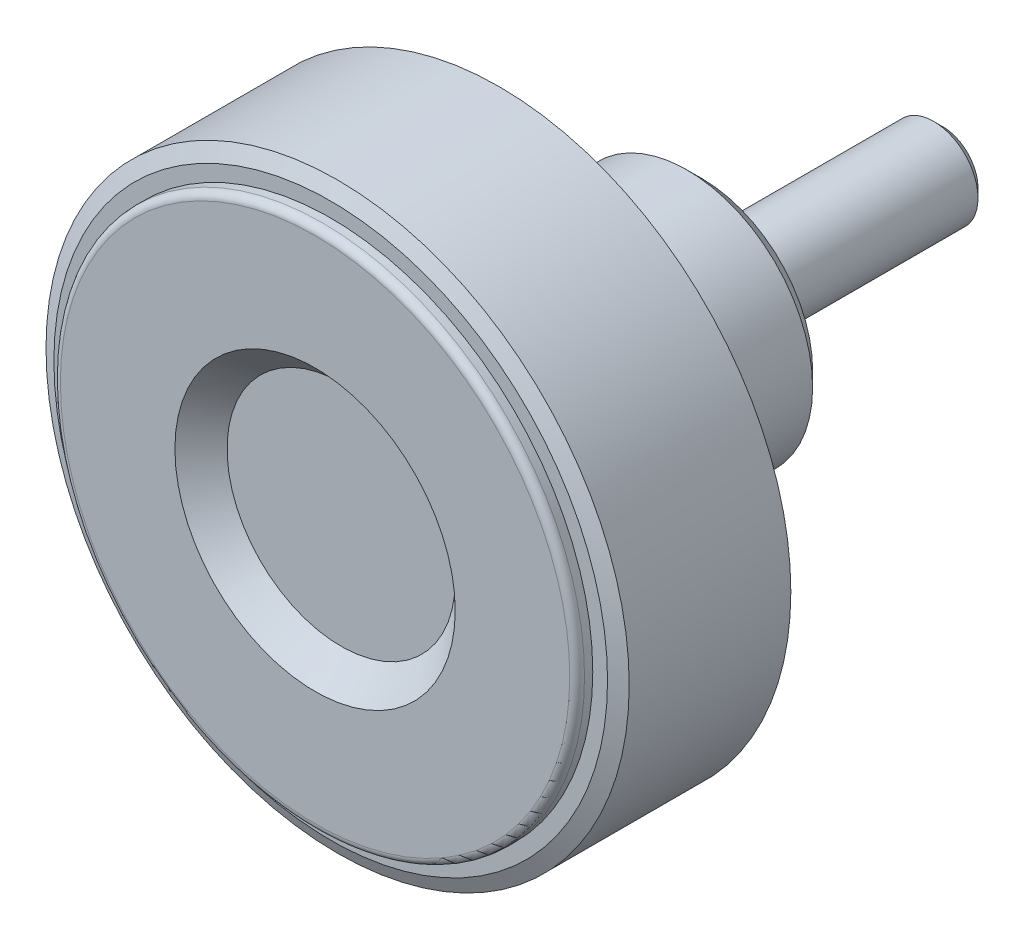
ISO-10303-21;
HEADER;
FILE_DESCRIPTION(('STEP AP214'),'2;1');
FILE_NAME('part.step','',(''),(''),'','','');
FILE_SCHEMA(('AUTOMOTIVE_DESIGN { 1 0 10303 214 1 1 1 1 }'));
ENDSEC;
DATA;
#1=APPLICATION_CONTEXT('core data for automotive mechanical design processes');
#2=APPLICATION_PROTOCOL_DEFINITION('international standard','automotive_design',2000,#1);
#3=PRODUCT_CONTEXT('',#1,'mechanical');
#4=PRODUCT('Part','Part','',(#3));
#5=PRODUCT_RELATED_PRODUCT_CATEGORY('part','',(#4));
#6=PRODUCT_DEFINITION_FORMATION('','',#4);
#7=PRODUCT_DEFINITION_CONTEXT('part definition',#1,'design');
#8=PRODUCT_DEFINITION('design','',#6,#7);
#9=PRODUCT_DEFINITION_SHAPE('','',#8);
#10=(LENGTH_UNIT() NAMED_UNIT(*) SI_UNIT(.MILLI.,.METRE.));
#11=(NAMED_UNIT(*) PLANE_ANGLE_UNIT() SI_UNIT($,.RADIAN.));
#12=(NAMED_UNIT(*) SI_UNIT($,.STERADIAN.) SOLID_ANGLE_UNIT());
#13=UNCERTAINTY_MEASURE_WITH_UNIT(LENGTH_MEASURE(1.E-05),#10,'distance_accuracy_value','');
#14=(GEOMETRIC_REPRESENTATION_CONTEXT(3) GLOBAL_UNCERTAINTY_ASSIGNED_CONTEXT((#13)) GLOBAL_UNIT_ASSIGNED_CONTEXT((#10,
#11,#12)) REPRESENTATION_CONTEXT('',''));
#15=CARTESIAN_POINT('',(0.,0.,0.));
#16=DIRECTION('',(0.,0.,1.));
#17=DIRECTION('',(1.,0.,0.));
#18=AXIS2_PLACEMENT_3D('',#15,#16,#17);
#19=CARTESIAN_POINT('',(0.,0.,-4.19325));
#20=DIRECTION('',(0.,0.,1.));
#21=DIRECTION('',(1.,0.,0.));
#22=AXIS2_PLACEMENT_3D('',#19,#20,#21);
#23=CYLINDRICAL_SURFACE('',#22,3.);
#24=CARTESIAN_POINT('',(0.,0.,-15.4));
#25=DIRECTION('',(0.,0.,-1.));
#26=DIRECTION('',(-1.,0.,0.));
#27=AXIS2_PLACEMENT_3D('',#24,#25,#26);
#28=CIRCLE('',#27,3.);
#29=CARTESIAN_POINT('',(-3.,0.,-15.4));
#30=VERTEX_POINT('',#29);
#31=EDGE_CURVE('E9',#30,#30,#28,.F.);
#32=ORIENTED_EDGE('',*,*,#31,.T.);
#33=EDGE_LOOP('',(#32));
#34=FACE_BOUND('',#33,.T.);
#35=CARTESIAN_POINT('',(0.,0.,0.));
#36=DIRECTION('',(0.,0.,1.));
#37=DIRECTION('',(1.,0.,0.));
#38=AXIS2_PLACEMENT_3D('',#35,#36,#37);
#39=CIRCLE('',#38,3.);
#40=CARTESIAN_POINT('',(3.,0.,0.));
#41=VERTEX_POINT('',#40);
#42=EDGE_CURVE('E212',#41,#41,#39,.T.);
#43=ORIENTED_EDGE('',*,*,#42,.F.);
#44=EDGE_LOOP('',(#43));
#45=FACE_BOUND('',#44,.T.);
#46=ADVANCED_FACE('F14',(#34,#45),#23,.T.);
#47=CARTESIAN_POINT('',(0.,2.,0.));
#48=DIRECTION('',(0.,0.,-1.));
#49=DIRECTION('',(-1.,0.,0.));
#50=AXIS2_PLACEMENT_3D('',#47,#48,#49);
#51=PLANE('',#50);
#52=CARTESIAN_POINT('',(0.,0.,0.));
#53=DIRECTION('',(0.,0.,1.));
#54=DIRECTION('',(1.,0.,0.));
#55=AXIS2_PLACEMENT_3D('',#52,#53,#54);
#56=CIRCLE('',#55,4.);
#57=CARTESIAN_POINT('',(4.,0.,0.));
#58=VERTEX_POINT('',#57);
#59=EDGE_CURVE('E209',#58,#58,#56,.T.);
#60=ORIENTED_EDGE('',*,*,#59,.F.);
#61=EDGE_LOOP('',(#60));
#62=FACE_BOUND('',#61,.T.);
#63=ORIENTED_EDGE('',*,*,#42,.T.);
#64=EDGE_LOOP('',(#63));
#65=FACE_BOUND('',#64,.T.);
#66=ADVANCED_FACE('F402',(#62,#65),#51,.T.);
#67=CARTESIAN_POINT('',(0.,0.,0.15));
#68=DIRECTION('',(0.,0.,1.));
#69=DIRECTION('',(1.,0.,0.));
#70=AXIS2_PLACEMENT_3D('',#67,#68,#69);
#71=CYLINDRICAL_SURFACE('',#70,4.);
#72=ORIENTED_EDGE('',*,*,#59,.T.);
#73=EDGE_LOOP('',(#72));
#74=FACE_BOUND('',#73,.T.);
#75=CARTESIAN_POINT('',(0.,0.,0.3));
#76=DIRECTION('',(0.,0.,1.));
#77=DIRECTION('',(1.,0.,0.));
#78=AXIS2_PLACEMENT_3D('',#75,#76,#77);
#79=CIRCLE('',#78,4.);
#80=CARTESIAN_POINT('',(4.,0.,0.3));
#81=VERTEX_POINT('',#80);
#82=EDGE_CURVE('E206',#81,#81,#79,.T.);
#83=ORIENTED_EDGE('',*,*,#82,.F.);
#84=EDGE_LOOP('',(#83));
#85=FACE_BOUND('',#84,.T.);
#86=ADVANCED_FACE('F406',(#74,#85),#71,.T.);
#87=CARTESIAN_POINT('',(0.,5.75,0.3));
#88=DIRECTION('',(0.,0.,-1.));
#89=DIRECTION('',(-1.,0.,0.));
#90=AXIS2_PLACEMENT_3D('',#87,#88,#89);
#91=PLANE('',#90);
#92=CARTESIAN_POINT('',(0.,0.,0.3));
#93=DIRECTION('',(0.,0.,1.));
#94=DIRECTION('',(1.,0.,0.));
#95=AXIS2_PLACEMENT_3D('',#92,#93,#94);
#96=CIRCLE('',#95,7.5);
#97=CARTESIAN_POINT('',(7.5,0.,0.3));
#98=VERTEX_POINT('',#97);
#99=EDGE_CURVE('E175',#98,#98,#96,.T.);
#100=ORIENTED_EDGE('',*,*,#99,.F.);
#101=EDGE_LOOP('',(#100));
#102=FACE_BOUND('',#101,.T.);
#103=ORIENTED_EDGE('',*,*,#82,.T.);
#104=EDGE_LOOP('',(#103));
#105=FACE_BOUND('',#104,.T.);
#106=ADVANCED_FACE('F413',(#102,#105),#91,.T.);
#107=CARTESIAN_POINT('',(0.,0.,1.3));
#108=DIRECTION('',(0.,0.,1.));
#109=DIRECTION('',(1.,0.,0.));
#110=AXIS2_PLACEMENT_3D('',#107,#108,#109);
#111=CONICAL_SURFACE('',#110,8.5,0.785398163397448);
#112=ORIENTED_EDGE('',*,*,#99,.T.);
#113=EDGE_LOOP('',(#112));
#114=FACE_BOUND('',#113,.T.);
#115=CARTESIAN_POINT('',(0.,0.,1.3));
#116=DIRECTION('',(0.,0.,1.));
#117=DIRECTION('',(1.,0.,0.));
#118=AXIS2_PLACEMENT_3D('',#115,#116,#117);
#119=CIRCLE('',#118,8.5);
#120=CARTESIAN_POINT('',(8.5,0.,1.3));
#121=VERTEX_POINT('',#120);
#122=EDGE_CURVE('E172',#121,#121,#119,.T.);
#123=ORIENTED_EDGE('',*,*,#122,.F.);
#124=EDGE_LOOP('',(#123));
#125=FACE_BOUND('',#124,.T.);
#126=ADVANCED_FACE('F420',(#114,#125),#111,.T.);
#127=CARTESIAN_POINT('',(0.,0.,11.1916666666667));
#128=DIRECTION('',(0.,0.,1.));
#129=DIRECTION('',(1.,0.,0.));
#130=AXIS2_PLACEMENT_3D('',#127,#128,#129);
#131=CYLINDRICAL_SURFACE('',#130,8.5);
#132=ORIENTED_EDGE('',*,*,#122,.T.);
#133=EDGE_LOOP('',(#132));
#134=FACE_BOUND('',#133,.T.);
#135=CARTESIAN_POINT('',(0.,0.,21.0833333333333));
#136=DIRECTION('',(0.,0.,-1.));
#137=DIRECTION('',(-1.,0.,0.));
#138=AXIS2_PLACEMENT_3D('',#135,#136,#137);
#139=CIRCLE('',#138,8.5);
#140=CARTESIAN_POINT('',(-8.5,0.,21.0833333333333));
#141=VERTEX_POINT('',#140);
#142=EDGE_CURVE('E75',#141,#141,#139,.T.);
#143=ORIENTED_EDGE('',*,*,#142,.T.);
#144=EDGE_LOOP('',(#143));
#145=FACE_BOUND('',#144,.T.);
#146=ADVANCED_FACE('F423',(#134,#145),#131,.T.);
#147=CARTESIAN_POINT('',(0.,0.,21.0833333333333));
#148=DIRECTION('',(0.,0.,-1.));
#149=DIRECTION('',(-1.,0.,0.));
#150=AXIS2_PLACEMENT_3D('',#147,#148,#149);
#151=TOROIDAL_SURFACE('',#150,9.5,1.);
#152=CARTESIAN_POINT('',(0.,0.,22.0833333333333));
#153=DIRECTION('',(0.,0.,-1.));
#154=DIRECTION('',(1.,0.,0.));
#155=AXIS2_PLACEMENT_3D('',#152,#153,#154);
#156=CIRCLE('',#155,9.5);
#157=CARTESIAN_POINT('',(-9.5,0.,22.0833333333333));
#158=VERTEX_POINT('',#157);
#159=CARTESIAN_POINT('',(9.5,0.,22.0833333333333));
#160=VERTEX_POINT('',#159);
#161=EDGE_CURVE('E68',#158,#160,#156,.F.);
#162=ORIENTED_EDGE('',*,*,#161,.F.);
#163=CARTESIAN_POINT('',(0.,0.,22.0833333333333));
#164=DIRECTION('',(0.,0.,-1.));
#165=DIRECTION('',(-1.,0.,0.));
#166=AXIS2_PLACEMENT_3D('',#163,#164,#165);
#167=CIRCLE('',#166,9.5);
#168=CARTESIAN_POINT('',(0.,9.5,22.0833333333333));
#169=VERTEX_POINT('',#168);
#170=EDGE_CURVE('E71',#169,#158,#167,.F.);
#171=ORIENTED_EDGE('',*,*,#170,.F.);
#172=CARTESIAN_POINT('',(0.,0.,22.0833333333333));
#173=DIRECTION('',(0.,0.,-1.));
#174=DIRECTION('',(0.,1.,0.));
#175=AXIS2_PLACEMENT_3D('',#172,#173,#174);
#176=CIRCLE('',#175,9.5);
#177=EDGE_CURVE('E63',#160,#169,#176,.F.);
#178=ORIENTED_EDGE('',*,*,#177,.F.);
#179=EDGE_LOOP('',(#162,#171,#178));
#180=FACE_BOUND('',#179,.T.);
#181=ORIENTED_EDGE('',*,*,#142,.F.);
#182=EDGE_LOOP('',(#181));
#183=FACE_BOUND('',#182,.T.);
#184=ADVANCED_FACE('F66',(#180,#183),#151,.F.);
#185=CARTESIAN_POINT('',(0.,11.8461538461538,22.0833333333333));
#186=DIRECTION('',(0.,0.,-1.));
#187=DIRECTION('',(-1.,0.,0.));
#188=AXIS2_PLACEMENT_3D('',#185,#186,#187);
#189=PLANE('',#188);
#190=CARTESIAN_POINT('',(0.,0.,22.0833333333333));
#191=DIRECTION('',(0.,0.,1.));
#192=DIRECTION('',(-1.,0.,0.));
#193=AXIS2_PLACEMENT_3D('',#190,#191,#192);
#194=CIRCLE('',#193,14.1923076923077);
#195=CARTESIAN_POINT('',(14.1923076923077,0.,22.0833333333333));
#196=VERTEX_POINT('',#195);
#197=CARTESIAN_POINT('',(-14.1923076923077,0.,22.0833333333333));
#198=VERTEX_POINT('',#197);
#199=EDGE_CURVE('E81',#196,#198,#194,.F.);
#200=ORIENTED_EDGE('',*,*,#199,.T.);
#201=CARTESIAN_POINT('',(0.,0.,22.0833333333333));
#202=DIRECTION('',(0.,0.,1.));
#203=DIRECTION('',(0.,1.,0.));
#204=AXIS2_PLACEMENT_3D('',#201,#202,#203);
#205=CIRCLE('',#204,14.1923076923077);
#206=CARTESIAN_POINT('',(0.,14.1923076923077,22.0833333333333));
#207=VERTEX_POINT('',#206);
#208=EDGE_CURVE('E130',#198,#207,#205,.F.);
#209=ORIENTED_EDGE('',*,*,#208,.T.);
#210=CARTESIAN_POINT('',(0.,0.,22.0833333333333));
#211=DIRECTION('',(0.,0.,1.));
#212=DIRECTION('',(1.,0.,0.));
#213=AXIS2_PLACEMENT_3D('',#210,#211,#212);
#214=CIRCLE('',#213,14.1923076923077);
#215=EDGE_CURVE('E143',#207,#196,#214,.F.);
#216=ORIENTED_EDGE('',*,*,#215,.T.);
#217=EDGE_LOOP('',(#200,#209,#216));
#218=FACE_BOUND('',#217,.T.);
#219=ORIENTED_EDGE('',*,*,#170,.T.);
#220=ORIENTED_EDGE('',*,*,#161,.T.);
#221=ORIENTED_EDGE('',*,*,#177,.T.);
#222=EDGE_LOOP('',(#219,#220,#221));
#223=FACE_BOUND('',#222,.T.);
#224=ADVANCED_FACE('F79',(#218,#223),#189,.T.);
#225=CARTESIAN_POINT('',(0.,0.,21.0833333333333));
#226=DIRECTION('',(0.,0.,-1.));
#227=DIRECTION('',(-1.,0.,0.));
#228=AXIS2_PLACEMENT_3D('',#225,#226,#227);
#229=TOROIDAL_SURFACE('',#228,14.1923076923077,1.);
#230=ORIENTED_EDGE('',*,*,#208,.F.);
#231=ORIENTED_EDGE('',*,*,#199,.F.);
#232=ORIENTED_EDGE('',*,*,#215,.F.);
#233=EDGE_LOOP('',(#230,#231,#232));
#234=FACE_BOUND('',#233,.T.);
#235=CARTESIAN_POINT('',(0.,0.,21.0833333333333));
#236=DIRECTION('',(0.,0.,1.));
#237=DIRECTION('',(1.,0.,0.));
#238=AXIS2_PLACEMENT_3D('',#235,#236,#237);
#239=CIRCLE('',#238,15.1923076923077);
#240=CARTESIAN_POINT('',(15.1923076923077,0.,21.0833333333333));
#241=VERTEX_POINT('',#240);
#242=EDGE_CURVE('E203',#241,#241,#239,.F.);
#243=ORIENTED_EDGE('',*,*,#242,.T.);
#244=EDGE_LOOP('',(#243));
#245=FACE_BOUND('',#244,.T.);
#246=ADVANCED_FACE('F100',(#234,#245),#229,.F.);
#247=CARTESIAN_POINT('',(0.,0.,16.7916666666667));
#248=DIRECTION('',(0.,0.,1.));
#249=DIRECTION('',(1.,0.,0.));
#250=AXIS2_PLACEMENT_3D('',#247,#248,#249);
#251=CYLINDRICAL_SURFACE('',#250,15.1923076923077);
#252=ORIENTED_EDGE('',*,*,#242,.F.);
#253=EDGE_LOOP('',(#252));
#254=FACE_BOUND('',#253,.T.);
#255=CARTESIAN_POINT('',(0.,0.,12.5));
#256=DIRECTION('',(0.,0.,1.));
#257=DIRECTION('',(1.,0.,0.));
#258=AXIS2_PLACEMENT_3D('',#255,#256,#257);
#259=CIRCLE('',#258,15.1923076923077);
#260=CARTESIAN_POINT('',(15.1923076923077,0.,12.5));
#261=VERTEX_POINT('',#260);
#262=EDGE_CURVE('E199',#261,#261,#259,.T.);
#263=ORIENTED_EDGE('',*,*,#262,.F.);
#264=EDGE_LOOP('',(#263));
#265=FACE_BOUND('',#264,.T.);
#266=ADVANCED_FACE('F326',(#254,#265),#251,.F.);
#267=CARTESIAN_POINT('',(0.,16.2211538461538,12.5));
#268=DIRECTION('',(0.,0.,-1.));
#269=DIRECTION('',(-1.,0.,0.));
#270=AXIS2_PLACEMENT_3D('',#267,#268,#269);
#271=PLANE('',#270);
#272=CARTESIAN_POINT('',(0.,0.,12.5));
#273=DIRECTION('',(0.,0.,1.));
#274=DIRECTION('',(-1.,0.,0.));
#275=AXIS2_PLACEMENT_3D('',#272,#273,#274);
#276=CIRCLE('',#275,17.25);
#277=CARTESIAN_POINT('',(-17.25,0.,12.5));
#278=VERTEX_POINT('',#277);
#279=CARTESIAN_POINT('',(17.25,0.,12.5));
#280=VERTEX_POINT('',#279);
#281=EDGE_CURVE('E261',#278,#280,#276,.T.);
#282=ORIENTED_EDGE('',*,*,#281,.F.);
#283=CARTESIAN_POINT('',(0.,0.,12.5));
#284=DIRECTION('',(0.,0.,1.));
#285=DIRECTION('',(0.,1.,0.));
#286=AXIS2_PLACEMENT_3D('',#283,#284,#285);
#287=CIRCLE('',#286,17.25);
#288=CARTESIAN_POINT('',(0.,17.25,12.5));
#289=VERTEX_POINT('',#288);
#290=EDGE_CURVE('E296',#289,#278,#287,.T.);
#291=ORIENTED_EDGE('',*,*,#290,.F.);
#292=CARTESIAN_POINT('',(0.,0.,12.5));
#293=DIRECTION('',(0.,0.,1.));
#294=DIRECTION('',(1.,0.,0.));
#295=AXIS2_PLACEMENT_3D('',#292,#293,#294);
#296=CIRCLE('',#295,17.25);
#297=EDGE_CURVE('E202',#280,#289,#296,.T.);
#298=ORIENTED_EDGE('',*,*,#297,.F.);
#299=EDGE_LOOP('',(#282,#291,#298));
#300=FACE_BOUND('',#299,.T.);
#301=ORIENTED_EDGE('',*,*,#262,.T.);
#302=EDGE_LOOP('',(#301));
#303=FACE_BOUND('',#302,.T.);
#304=ADVANCED_FACE('F272',(#300,#303),#271,.T.);
#305=CARTESIAN_POINT('',(0.,0.,13.));
#306=DIRECTION('',(0.,0.,-1.));
#307=DIRECTION('',(-1.,0.,0.));
#308=AXIS2_PLACEMENT_3D('',#305,#306,#307);
#309=TOROIDAL_SURFACE('',#308,17.25,0.5);
#310=ORIENTED_EDGE('',*,*,#290,.T.);
#311=ORIENTED_EDGE('',*,*,#281,.T.);
#312=ORIENTED_EDGE('',*,*,#297,.T.);
#313=EDGE_LOOP('',(#310,#311,#312));
#314=FACE_BOUND('',#313,.T.);
#315=CARTESIAN_POINT('',(0.,0.,13.));
#316=DIRECTION('',(0.,0.,1.));
#317=DIRECTION('',(1.,0.,0.));
#318=AXIS2_PLACEMENT_3D('',#315,#316,#317);
#319=CIRCLE('',#318,17.75);
#320=CARTESIAN_POINT('',(17.75,0.,13.));
#321=VERTEX_POINT('',#320);
#322=EDGE_CURVE('E198',#321,#321,#319,.T.);
#323=ORIENTED_EDGE('',*,*,#322,.F.);
#324=EDGE_LOOP('',(#323));
#325=FACE_BOUND('',#324,.T.);
#326=ADVANCED_FACE('F266',(#314,#325),#309,.T.);
#327=CARTESIAN_POINT('',(0.,0.,13.28));
#328=DIRECTION('',(0.,0.,1.));
#329=DIRECTION('',(1.,0.,0.));
#330=AXIS2_PLACEMENT_3D('',#327,#328,#329);
#331=CYLINDRICAL_SURFACE('',#330,17.75);
#332=ORIENTED_EDGE('',*,*,#322,.T.);
#333=EDGE_LOOP('',(#332));
#334=FACE_BOUND('',#333,.T.);
#335=CARTESIAN_POINT('',(0.,0.,13.56));
#336=DIRECTION('',(0.,0.,1.));
#337=DIRECTION('',(1.,0.,0.));
#338=AXIS2_PLACEMENT_3D('',#335,#336,#337);
#339=CIRCLE('',#338,17.75);
#340=CARTESIAN_POINT('',(17.75,0.,13.56));
#341=VERTEX_POINT('',#340);
#342=EDGE_CURVE('E195',#341,#341,#339,.T.);
#343=ORIENTED_EDGE('',*,*,#342,.F.);
#344=EDGE_LOOP('',(#343));
#345=FACE_BOUND('',#344,.T.);
#346=ADVANCED_FACE('F271',(#334,#345),#331,.T.);
#347=CARTESIAN_POINT('',(0.,18.25,13.56));
#348=DIRECTION('',(0.,0.,-1.));
#349=DIRECTION('',(-1.,0.,0.));
#350=AXIS2_PLACEMENT_3D('',#347,#348,#349);
#351=PLANE('',#350);
#352=CARTESIAN_POINT('',(0.,0.,13.56));
#353=DIRECTION('',(0.,0.,1.));
#354=DIRECTION('',(1.,0.,0.));
#355=AXIS2_PLACEMENT_3D('',#352,#353,#354);
#356=CIRCLE('',#355,18.75);
#357=CARTESIAN_POINT('',(18.75,0.,13.56));
#358=VERTEX_POINT('',#357);
#359=EDGE_CURVE('E191',#358,#358,#356,.T.);
#360=ORIENTED_EDGE('',*,*,#359,.F.);
#361=EDGE_LOOP('',(#360));
#362=FACE_BOUND('',#361,.T.);
#363=ORIENTED_EDGE('',*,*,#342,.T.);
#364=EDGE_LOOP('',(#363));
#365=FACE_BOUND('',#364,.T.);
#366=ADVANCED_FACE('F339',(#362,#365),#351,.T.);
#367=CARTESIAN_POINT('',(0.,0.,14.026307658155));
#368=DIRECTION('',(0.,0.,1.));
#369=DIRECTION('',(1.,0.,0.));
#370=AXIS2_PLACEMENT_3D('',#367,#368,#369);
#371=CONICAL_SURFACE('',#370,19.75,1.13446401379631);
#372=CARTESIAN_POINT('',(-1.50102152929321E-13,-1.52766688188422E-12,14.026307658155));
#373=DIRECTION('',(0.,0.,-1.));
#374=DIRECTION('',(-1.,0.,0.));
#375=AXIS2_PLACEMENT_3D('',#372,#373,#374);
#376=CIRCLE('',#375,19.7500000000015);
#377=CARTESIAN_POINT('',(-19.7500000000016,-1.52766688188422E-12,14.026307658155));
#378=VERTEX_POINT('',#377);
#379=EDGE_CURVE('E194',#378,#378,#376,.F.);
#380=ORIENTED_EDGE('',*,*,#379,.F.);
#381=EDGE_LOOP('',(#380));
#382=FACE_BOUND('',#381,.T.);
#383=ORIENTED_EDGE('',*,*,#359,.T.);
#384=EDGE_LOOP('',(#383));
#385=FACE_BOUND('',#384,.T.);
#386=ADVANCED_FACE('F337',(#382,#385),#371,.T.);
#387=CARTESIAN_POINT('',(0.,3.86363636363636,24.7333333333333));
#388=DIRECTION('',(0.,0.,1.));
#389=DIRECTION('',(1.,0.,0.));
#390=AXIS2_PLACEMENT_3D('',#387,#388,#389);
#391=PLANE('',#390);
#392=CARTESIAN_POINT('',(0.,0.,24.7333333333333));
#393=DIRECTION('',(0.,0.,1.));
#394=DIRECTION('',(1.,0.,0.));
#395=AXIS2_PLACEMENT_3D('',#392,#393,#394);
#396=CIRCLE('',#395,7.7272727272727);
#397=CARTESIAN_POINT('',(7.7272727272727,0.,24.7333333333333));
#398=VERTEX_POINT('',#397);
#399=EDGE_CURVE('E179',#398,#398,#396,.T.);
#400=ORIENTED_EDGE('',*,*,#399,.T.);
#401=EDGE_LOOP('',(#400));
#402=FACE_BOUND('',#401,.T.);
#403=ADVANCED_FACE('F239',(#402),#391,.T.);
#404=CARTESIAN_POINT('',(0.,0.,26.5));
#405=DIRECTION('',(0.,0.,1.));
#406=DIRECTION('',(1.,0.,0.));
#407=AXIS2_PLACEMENT_3D('',#404,#405,#406);
#408=CONICAL_SURFACE('',#407,9.49393939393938,0.785398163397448);
#409=CARTESIAN_POINT('',(0.,0.,26.5));
#410=DIRECTION('',(0.,0.,1.));
#411=DIRECTION('',(1.,0.,0.));
#412=AXIS2_PLACEMENT_3D('',#409,#410,#411);
#413=CIRCLE('',#412,9.49393939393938);
#414=CARTESIAN_POINT('',(9.49393939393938,0.,26.5));
#415=VERTEX_POINT('',#414);
#416=EDGE_CURVE('E176',#415,#415,#413,.F.);
#417=ORIENTED_EDGE('',*,*,#416,.F.);
#418=EDGE_LOOP('',(#417));
#419=FACE_BOUND('',#418,.T.);
#420=ORIENTED_EDGE('',*,*,#399,.F.);
#421=EDGE_LOOP('',(#420));
#422=FACE_BOUND('',#421,.T.);
#423=ADVANCED_FACE('F237',(#419,#422),#408,.F.);
#424=CARTESIAN_POINT('',(0.,13.3719696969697,26.5));
#425=DIRECTION('',(0.,0.,1.));
#426=DIRECTION('',(1.,0.,0.));
#427=AXIS2_PLACEMENT_3D('',#424,#425,#426);
#428=PLANE('',#427);
#429=ORIENTED_EDGE('',*,*,#416,.T.);
#430=EDGE_LOOP('',(#429));
#431=FACE_BOUND('',#430,.T.);
#432=CARTESIAN_POINT('',(0.,0.,26.5));
#433=DIRECTION('',(0.,0.,-1.));
#434=DIRECTION('',(-1.,0.,0.));
#435=AXIS2_PLACEMENT_3D('',#432,#433,#434);
#436=CIRCLE('',#435,17.25);
#437=CARTESIAN_POINT('',(0.,17.25,26.5));
#438=VERTEX_POINT('',#437);
#439=CARTESIAN_POINT('',(-17.25,0.,26.5));
#440=VERTEX_POINT('',#439);
#441=EDGE_CURVE('E216',#438,#440,#436,.F.);
#442=ORIENTED_EDGE('',*,*,#441,.T.);
#443=CARTESIAN_POINT('',(0.,0.,26.5));
#444=DIRECTION('',(0.,0.,-1.));
#445=DIRECTION('',(1.,0.,0.));
#446=AXIS2_PLACEMENT_3D('',#443,#444,#445);
#447=CIRCLE('',#446,17.25);
#448=CARTESIAN_POINT('',(17.25,0.,26.5));
#449=VERTEX_POINT('',#448);
#450=EDGE_CURVE('E31',#440,#449,#447,.F.);
#451=ORIENTED_EDGE('',*,*,#450,.T.);
#452=CARTESIAN_POINT('',(0.,0.,26.5));
#453=DIRECTION('',(0.,0.,-1.));
#454=DIRECTION('',(0.,1.,0.));
#455=AXIS2_PLACEMENT_3D('',#452,#453,#454);
#456=CIRCLE('',#455,17.25);
#457=EDGE_CURVE('E182',#449,#438,#456,.F.);
#458=ORIENTED_EDGE('',*,*,#457,.T.);
#459=EDGE_LOOP('',(#442,#451,#458));
#460=FACE_BOUND('',#459,.T.);
#461=ADVANCED_FACE('F235',(#431,#460),#428,.T.);
#462=CARTESIAN_POINT('',(0.,0.,26.));
#463=DIRECTION('',(0.,0.,-1.));
#464=DIRECTION('',(-1.,0.,0.));
#465=AXIS2_PLACEMENT_3D('',#462,#463,#464);
#466=TOROIDAL_SURFACE('',#465,17.25,0.5);
#467=CARTESIAN_POINT('',(0.,0.,26.));
#468=DIRECTION('',(0.,0.,-1.));
#469=DIRECTION('',(-1.,0.,0.));
#470=AXIS2_PLACEMENT_3D('',#467,#468,#469);
#471=CIRCLE('',#470,17.75);
#472=CARTESIAN_POINT('',(-17.75,0.,26.));
#473=VERTEX_POINT('',#472);
#474=EDGE_CURVE('E183',#473,#473,#471,.F.);
#475=ORIENTED_EDGE('',*,*,#474,.T.);
#476=EDGE_LOOP('',(#475));
#477=FACE_BOUND('',#476,.T.);
#478=ORIENTED_EDGE('',*,*,#450,.F.);
#479=ORIENTED_EDGE('',*,*,#441,.F.);
#480=ORIENTED_EDGE('',*,*,#457,.F.);
#481=EDGE_LOOP('',(#478,#479,#480));
#482=FACE_BOUND('',#481,.T.);
#483=ADVANCED_FACE('F223',(#477,#482),#466,.T.);
#484=CARTESIAN_POINT('',(0.,0.,25.72));
#485=DIRECTION('',(0.,0.,1.));
#486=DIRECTION('',(1.,0.,0.));
#487=AXIS2_PLACEMENT_3D('',#484,#485,#486);
#488=CYLINDRICAL_SURFACE('',#487,17.75);
#489=ORIENTED_EDGE('',*,*,#474,.F.);
#490=EDGE_LOOP('',(#489));
#491=FACE_BOUND('',#490,.T.);
#492=CARTESIAN_POINT('',(0.,0.,25.44));
#493=DIRECTION('',(0.,0.,1.));
#494=DIRECTION('',(1.,0.,0.));
#495=AXIS2_PLACEMENT_3D('',#492,#493,#494);
#496=CIRCLE('',#495,17.75);
#497=CARTESIAN_POINT('',(17.75,0.,25.44));
#498=VERTEX_POINT('',#497);
#499=EDGE_CURVE('E184',#498,#498,#496,.T.);
#500=ORIENTED_EDGE('',*,*,#499,.T.);
#501=EDGE_LOOP('',(#500));
#502=FACE_BOUND('',#501,.T.);
#503=ADVANCED_FACE('F234',(#491,#502),#488,.T.);
#504=CARTESIAN_POINT('',(0.,0.,24.973692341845));
#505=DIRECTION('',(0.,0.,-1.));
#506=DIRECTION('',(-1.,0.,0.));
#507=AXIS2_PLACEMENT_3D('',#504,#505,#506);
#508=CONICAL_SURFACE('',#507,19.75,1.13446401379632);
#509=CARTESIAN_POINT('',(0.,0.,25.44));
#510=DIRECTION('',(0.,0.,-1.));
#511=DIRECTION('',(-1.,0.,0.));
#512=AXIS2_PLACEMENT_3D('',#509,#510,#511);
#513=CIRCLE('',#512,18.75);
#514=CARTESIAN_POINT('',(-18.75,0.,25.44));
#515=VERTEX_POINT('',#514);
#516=EDGE_CURVE('E187',#515,#515,#513,.F.);
#517=ORIENTED_EDGE('',*,*,#516,.F.);
#518=EDGE_LOOP('',(#517));
#519=FACE_BOUND('',#518,.T.);
#520=CARTESIAN_POINT('',(0.,0.,24.973692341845));
#521=DIRECTION('',(0.,0.,-1.));
#522=DIRECTION('',(0.,1.,0.));
#523=AXIS2_PLACEMENT_3D('',#520,#521,#522);
#524=CIRCLE('',#523,19.75);
#525=CARTESIAN_POINT('',(0.,19.75,24.973692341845));
#526=VERTEX_POINT('',#525);
#527=EDGE_CURVE('E190',#526,#526,#524,.F.);
#528=ORIENTED_EDGE('',*,*,#527,.T.);
#529=EDGE_LOOP('',(#528));
#530=FACE_BOUND('',#529,.T.);
#531=ADVANCED_FACE('F358',(#519,#530),#508,.T.);
#532=CARTESIAN_POINT('',(0.,18.25,25.44));
#533=DIRECTION('',(0.,0.,1.));
#534=DIRECTION('',(1.,0.,0.));
#535=AXIS2_PLACEMENT_3D('',#532,#533,#534);
#536=PLANE('',#535);
#537=ORIENTED_EDGE('',*,*,#499,.F.);
#538=EDGE_LOOP('',(#537));
#539=FACE_BOUND('',#538,.T.);
#540=ORIENTED_EDGE('',*,*,#516,.T.);
#541=EDGE_LOOP('',(#540));
#542=FACE_BOUND('',#541,.T.);
#543=ADVANCED_FACE('F356',(#539,#542),#536,.T.);
#544=CARTESIAN_POINT('',(-1.50102152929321E-13,-1.52766688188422E-12,0.));
#545=DIRECTION('',(0.,0.,-1.));
#546=DIRECTION('',(-1.,0.,0.));
#547=AXIS2_PLACEMENT_3D('',#544,#545,#546);
#548=CYLINDRICAL_SURFACE('',#547,19.7500000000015);
#549=ORIENTED_EDGE('',*,*,#379,.T.);
#550=EDGE_LOOP('',(#549));
#551=FACE_BOUND('',#550,.T.);
#552=ORIENTED_EDGE('',*,*,#527,.F.);
#553=EDGE_LOOP('',(#552));
#554=FACE_BOUND('',#553,.T.);
#555=ADVANCED_FACE('F352',(#551,#554),#548,.T.);
#556=CARTESIAN_POINT('',(0.,0.,-16.));
#557=DIRECTION('',(0.,0.,-1.));
#558=DIRECTION('',(-1.,0.,0.));
#559=AXIS2_PLACEMENT_3D('',#556,#557,#558);
#560=PLANE('',#559);
#561=CARTESIAN_POINT('',(0.,0.,-16.));
#562=DIRECTION('',(0.,0.,-1.));
#563=DIRECTION('',(-1.,0.,0.));
#564=AXIS2_PLACEMENT_3D('',#561,#562,#563);
#565=CIRCLE('',#564,2.4);
#566=CARTESIAN_POINT('',(-2.4,0.,-16.));
#567=VERTEX_POINT('',#566);
#568=EDGE_CURVE('E23',#567,#567,#565,.T.);
#569=ORIENTED_EDGE('',*,*,#568,.T.);
#570=EDGE_LOOP('',(#569));
#571=FACE_BOUND('',#570,.T.);
#572=ADVANCED_FACE('F355',(#571),#560,.T.);
#573=CARTESIAN_POINT('',(0.,0.,-16.));
#574=DIRECTION('',(0.,0.,1.));
#575=DIRECTION('',(1.,0.,0.));
#576=AXIS2_PLACEMENT_3D('',#573,#574,#575);
#577=CONICAL_SURFACE('',#576,2.4,0.785398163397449);
#578=ORIENTED_EDGE('',*,*,#31,.F.);
#579=EDGE_LOOP('',(#578));
#580=FACE_BOUND('',#579,.T.);
#581=ORIENTED_EDGE('',*,*,#568,.F.);
#582=EDGE_LOOP('',(#581));
#583=FACE_BOUND('',#582,.T.);
#584=ADVANCED_FACE('F16',(#580,#583),#577,.T.);
#585=CLOSED_SHELL('',(#46,#66,#86,#106,#126,#146,#184,#224,#246,#266,#304,#326,#346,#366,#386,
#403,#423,#461,#483,#503,#531,#543,#555,#572,#584));
#586=MANIFOLD_SOLID_BREP('B1',#585);
#587=ADVANCED_BREP_SHAPE_REPRESENTATION('',(#18,#586),#14);
#588=SHAPE_DEFINITION_REPRESENTATION(#9,#587);
ENDSEC;
END-ISO-10303-21;
